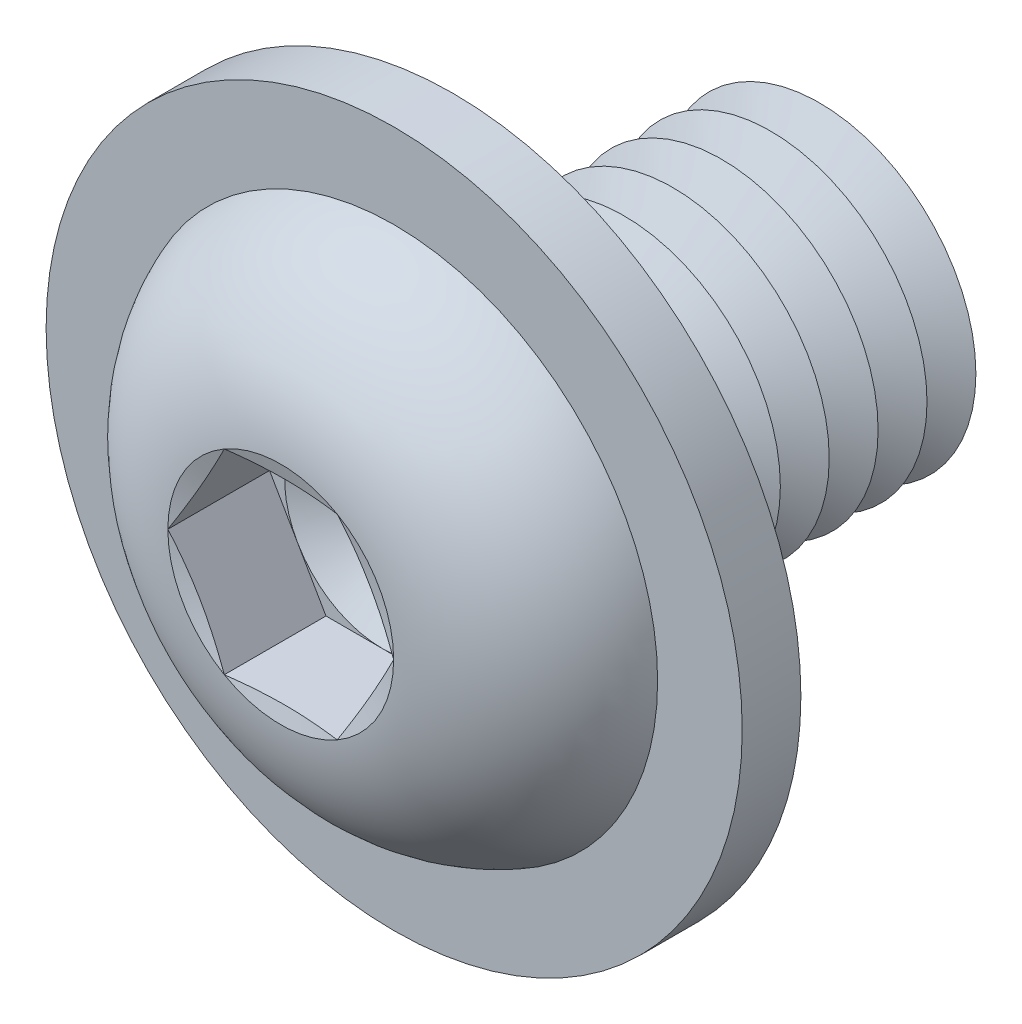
from build123d import *

# Parameters (mm, degrees)
FILLET1_R           = 0.625
LPATTERN1_COUNT     = 8
LPATTERN1_PITCH     = 1.25
CUT_EXTRUDE1_DEPTH  = 2.6
SKETCH5_R           = 8.9
SKETCH5_R_2         = 4.625
BOSS_EXTRUDE1_DEPTH = 1.5


with BuildPart() as part:
    # Sketch1 → Revolve1 (revolve)
    with BuildSketch(Plane(origin=(0, 0, 0), x_dir=(0, 0, -1), z_dir=(1, 0, 0)), mode=Mode.PRIVATE) as revolve1_sk:
        with BuildLine():
            Line((0, 4), (0, 7))
            ThreePointArc((0, 7), (-3.011595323, 5.81154966), (-4.4, 2.88675))
            Line((-4.4, 2.88675), (-4.013248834, 1.443375))
            Line((-4.013248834, 1.443375), (-4.4, 1.443375))
            Line((-4.4, 1.443375), (-4.4, 0))
            Line((-4.4, 0), (10, 0))
            Line((10, 0), (10, 4))
            Line((10, 4), (0, 4))
        make_face()
    revolve(revolve1_sk.sketch.rotate(Axis((0, 0, -10), (0, 0, 1)), 90), axis=Axis((0, 0, -10), (0, 0, 1)))

    # Fillet1
    fillet1_edges = [part.edges().sort_by_distance(p)[0] for p in [
        (4, 0, 0),
    ]]
    fillet(fillet1_edges, radius=FILLET1_R)

    # Sketch2 → Cut-Revolve1 (revolve, cut)
    with BuildSketch(Plane(origin=(0, 0, 0), x_dir=(0, 0, -1), z_dir=(1, 0, 0)), mode=Mode.PRIVATE) as cut_revolve1_sk:
        Polygon((9.375, 4), (10.625, 4), (10, 2.917468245), align=None)
    cut_revolve1 = revolve(cut_revolve1_sk.sketch.rotate(Axis((0, 0, -10), (0, 0, -1)), 270), axis=Axis((0, 0, -10), (0, 0, -1)), mode=Mode.SUBTRACT)

    # LPattern1: Cut-Revolve1 ×8
    with Locations(*[(0, 0, i * LPATTERN1_PITCH) for i in range(1, LPATTERN1_COUNT)]):
        add(cut_revolve1, mode=Mode.SUBTRACT)

    # Sketch3 → Cut-Extrude1 (cut)
    with BuildSketch(Plane.XY.offset(4.4)):
        Polygon((1.443375, 2.499998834), (-1.443375, 2.499998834), (-2.88675, 0), (-1.443375, -2.499998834), (1.443375, -2.499998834), (2.88675, 0), align=None)
    extrude(amount=-CUT_EXTRUDE1_DEPTH, mode=Mode.SUBTRACT)

    # Cut-Extrude2 cone 1 section (on through the dimple's axis) → Cut-Extrude2 (revolve, cut)
    with BuildSketch(Plane(origin=(0, 0, 1.8), x_dir=(0, -1, 0), z_dir=(1, 0, 0))):
        Polygon((0, 0), (2.499998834, 0), (0, 1.443375), align=None)
    revolve(axis=Axis((0, 0, 1.8), (0, 0, -1)), mode=Mode.SUBTRACT)

    # Sketch5 → Boss-Extrude1 (add)
    with BuildSketch(Plane(origin=(0, 0, 0), x_dir=(-1, 0, 0), z_dir=(0, 0, -1))):
        with Locations(Location((0, 0, 0), (0, 0, 90))):
            Circle(SKETCH5_R)
        Circle(SKETCH5_R_2, mode=Mode.SUBTRACT)
    extrude(amount=-BOSS_EXTRUDE1_DEPTH)


solid = part.part
